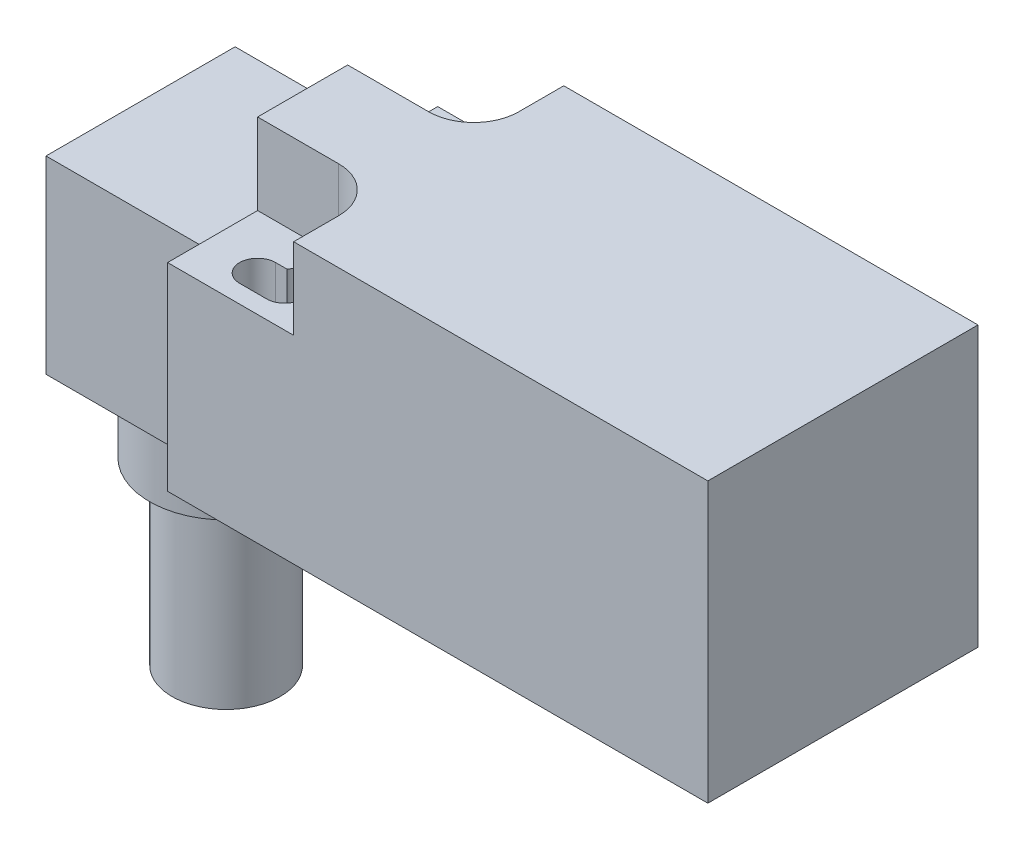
from build123d import *

# Parameters (mm, degrees)
ESQUISSE1_W             = 60
ESQUISSE1_H             = 31
EXTRUSION1_DEPTH        = 15
ENL_V_MAT_EXTRU_1_DEPTH = 9
ENL_V_MAT_EXTRU_2_DEPTH = 70.180922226
ESQUISSE4_W             = 21
ESQUISSE4_H             = 21
EXTRUSION2_DEPTH        = 18
ESQUISSE5_R             = 8.5
EXTRUSION3_DEPTH        = 8.5
ESQUISSE6_R             = 6
ESQUISSE6_R_2           = 4.25
EXTRUSION4_DEPTH        = 20


with BuildPart() as part:
    # Esquisse1 → Extrusion1 (new, symmetric)
    with BuildSketch(Plane.XY):
        with Locations((30, 0)):
            Rectangle(ESQUISSE1_W, ESQUISSE1_H)
    extrude(amount=EXTRUSION1_DEPTH, both=True)

    # Esquisse2 → Enl_v. mat.-Extru.1 (cut)
    with BuildSketch(Plane(origin=(0, 15.5, 0), x_dir=(-1, 0, 0), z_dir=(0, 1, 0))):
        with BuildLine():
            Line((0, -15), (-14, -15))
            Line((-14, -15), (-14, -10))
            ThreePointArc((-14, -10), (-12.535533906, -6.464466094), (-9, -5))
            Line((-9, -5), (0, -5))
            Line((0, -5), (0, -15))
        make_face()
        with BuildLine():
            Line((0, 15), (-14, 15))
            Line((-14, 15), (-14, 10))
            ThreePointArc((-14, 10), (-12.535533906, 6.464466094), (-9, 5))
            Line((-9, 5), (0, 5))
            Line((0, 5), (0, 15))
        make_face()
    extrude(amount=-ENL_V_MAT_EXTRU_1_DEPTH, mode=Mode.SUBTRACT)

    # Esquisse3 → Enl_v. mat.-Extru.2 (cut, through all)
    with BuildSketch(Plane.XZ.offset(15.5)):
        with BuildLine():
            Line((6, 13), (9, 13))
            ThreePointArc((9, 13), (10.414213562, 12.414213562), (11, 11))
            Line((11, 11), (11, 10))
            ThreePointArc((11, 10), (9.51763809, 8.068148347), (7.267949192, 9))
            Line((7.267949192, 9), (6, 9))
            ThreePointArc((6, 9), (4, 11), (6, 13))
        make_face()
        with BuildLine():
            Line((6, -9), (7.267949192, -9))
            ThreePointArc((7.267949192, -9), (9.51763809, -8.068148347), (11, -10))
            Line((11, -10), (11, -11))
            ThreePointArc((11, -11), (10.414213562, -12.414213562), (9, -13))
            Line((9, -13), (6, -13))
            ThreePointArc((6, -13), (4, -11), (6, -9))
        make_face()
    extrude(amount=-ENL_V_MAT_EXTRU_2_DEPTH, mode=Mode.SUBTRACT)


with BuildPart() as body_2:
    # Esquisse4 → Extrusion2 (new body)
    with BuildSketch(Plane.ZY):
        with Locations((0, -5)):
            Rectangle(ESQUISSE4_W, ESQUISSE4_H)
    extrude(amount=EXTRUSION2_DEPTH)


with BuildPart() as body_3:
    # Esquisse5 → Extrusion3 (new body)
    with BuildSketch(Plane.XZ.offset(15.5)):
        with Locations(Location((-8.5, 0, 0), (0, 0, 270))):
            Circle(ESQUISSE5_R)
    extrude(amount=EXTRUSION3_DEPTH)

    # Esquisse6 → Extrusion4 (add)
    with BuildSketch(Plane.XZ.offset(24)):
        with Locations(Location((-8.5, 0, 0), (0, 0, 270))):
            Circle(ESQUISSE6_R)
        with Locations(Location((-8.5, 0, 0), (0, 0, 270))):
            Circle(ESQUISSE6_R_2, mode=Mode.SUBTRACT)
    extrude(amount=EXTRUSION4_DEPTH)


solid = Compound([part.part, body_2.part, body_3.part])
